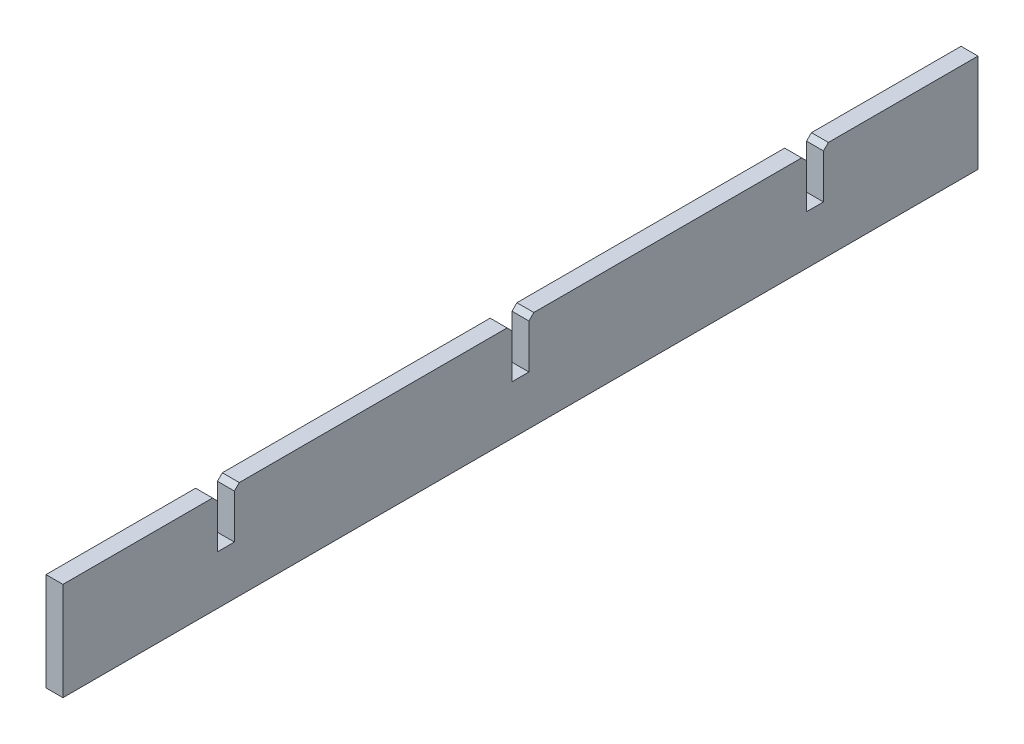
ISO-10303-21;
HEADER;
FILE_DESCRIPTION(('STEP AP214'),'2;1');
FILE_NAME('part.step','',(''),(''),'','','');
FILE_SCHEMA(('AUTOMOTIVE_DESIGN { 1 0 10303 214 1 1 1 1 }'));
ENDSEC;
DATA;
#1=APPLICATION_CONTEXT('core data for automotive mechanical design processes');
#2=APPLICATION_PROTOCOL_DEFINITION('international standard','automotive_design',2000,#1);
#3=PRODUCT_CONTEXT('',#1,'mechanical');
#4=PRODUCT('Part','Part','',(#3));
#5=PRODUCT_RELATED_PRODUCT_CATEGORY('part','',(#4));
#6=PRODUCT_DEFINITION_FORMATION('','',#4);
#7=PRODUCT_DEFINITION_CONTEXT('part definition',#1,'design');
#8=PRODUCT_DEFINITION('design','',#6,#7);
#9=PRODUCT_DEFINITION_SHAPE('','',#8);
#10=(LENGTH_UNIT() NAMED_UNIT(*) SI_UNIT(.MILLI.,.METRE.));
#11=(NAMED_UNIT(*) PLANE_ANGLE_UNIT() SI_UNIT($,.RADIAN.));
#12=(NAMED_UNIT(*) SI_UNIT($,.STERADIAN.) SOLID_ANGLE_UNIT());
#13=UNCERTAINTY_MEASURE_WITH_UNIT(LENGTH_MEASURE(1.E-05),#10,'distance_accuracy_value','');
#14=(GEOMETRIC_REPRESENTATION_CONTEXT(3) GLOBAL_UNCERTAINTY_ASSIGNED_CONTEXT((#13)) GLOBAL_UNIT_ASSIGNED_CONTEXT((#10,
#11,#12)) REPRESENTATION_CONTEXT('',''));
#15=CARTESIAN_POINT('',(0.,0.,0.));
#16=DIRECTION('',(0.,0.,1.));
#17=DIRECTION('',(1.,0.,0.));
#18=AXIS2_PLACEMENT_3D('',#15,#16,#17);
#19=CARTESIAN_POINT('',(17.25,0.,0.));
#20=DIRECTION('',(-1.,0.,0.));
#21=DIRECTION('',(0.,0.,1.));
#22=AXIS2_PLACEMENT_3D('',#19,#20,#21);
#23=PLANE('',#22);
#24=DIRECTION('',(0.,0.,1.));
#25=VECTOR('',#24,1.);
#26=CARTESIAN_POINT('',(17.25,50.,466.));
#27=LINE('',#26,#25);
#28=CARTESIAN_POINT('',(17.25,50.,13.625));
#29=VERTEX_POINT('',#28);
#30=CARTESIAN_POINT('',(17.25,50.,286.375));
#31=VERTEX_POINT('',#30);
#32=EDGE_CURVE('E249',#29,#31,#27,.T.);
#33=ORIENTED_EDGE('',*,*,#32,.T.);
#34=DIRECTION('',(0.,-0.707106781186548,0.707106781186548));
#35=VECTOR('',#34,1.);
#36=CARTESIAN_POINT('',(17.25,50.,286.375));
#37=LINE('',#36,#35);
#38=CARTESIAN_POINT('',(17.25,45.,291.375));
#39=VERTEX_POINT('',#38);
#40=EDGE_CURVE('E187',#31,#39,#37,.T.);
#41=ORIENTED_EDGE('',*,*,#40,.T.);
#42=DIRECTION('',(0.,-1.,0.));
#43=VECTOR('',#42,1.);
#44=CARTESIAN_POINT('',(17.25,0.,291.375));
#45=LINE('',#44,#43);
#46=CARTESIAN_POINT('',(17.25,0.,291.375));
#47=VERTEX_POINT('',#46);
#48=EDGE_CURVE('E182',#39,#47,#45,.T.);
#49=ORIENTED_EDGE('',*,*,#48,.T.);
#50=DIRECTION('',(0.,0.,-1.));
#51=VECTOR('',#50,1.);
#52=CARTESIAN_POINT('',(17.25,0.,0.));
#53=LINE('',#52,#51);
#54=CARTESIAN_POINT('',(17.25,0.,308.625));
#55=VERTEX_POINT('',#54);
#56=EDGE_CURVE('E186',#55,#47,#53,.T.);
#57=ORIENTED_EDGE('',*,*,#56,.F.);
#58=DIRECTION('',(0.,-1.,0.));
#59=VECTOR('',#58,1.);
#60=CARTESIAN_POINT('',(17.25,0.,308.625));
#61=LINE('',#60,#59);
#62=CARTESIAN_POINT('',(17.25,44.9999999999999,308.625));
#63=VERTEX_POINT('',#62);
#64=EDGE_CURVE('E199',#63,#55,#61,.T.);
#65=ORIENTED_EDGE('',*,*,#64,.F.);
#66=DIRECTION('',(0.,-0.70710678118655,-0.707106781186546));
#67=VECTOR('',#66,1.);
#68=CARTESIAN_POINT('',(17.25,50.,313.625));
#69=LINE('',#68,#67);
#70=CARTESIAN_POINT('',(17.25,50.,313.625));
#71=VERTEX_POINT('',#70);
#72=EDGE_CURVE('E336',#63,#71,#69,.F.);
#73=ORIENTED_EDGE('',*,*,#72,.T.);
#74=CARTESIAN_POINT('',(17.25,50.,466.));
#75=VERTEX_POINT('',#74);
#76=EDGE_CURVE('E242',#71,#75,#27,.T.);
#77=ORIENTED_EDGE('',*,*,#76,.T.);
#78=DIRECTION('',(0.,-1.,0.));
#79=VECTOR('',#78,1.);
#80=CARTESIAN_POINT('',(17.25,-50.,466.));
#81=LINE('',#80,#79);
#82=CARTESIAN_POINT('',(17.25,-50.,466.));
#83=VERTEX_POINT('',#82);
#84=EDGE_CURVE('E247',#75,#83,#81,.T.);
#85=ORIENTED_EDGE('',*,*,#84,.T.);
#86=DIRECTION('',(0.,0.,-1.));
#87=VECTOR('',#86,1.);
#88=CARTESIAN_POINT('',(17.25,-50.,466.));
#89=LINE('',#88,#87);
#90=CARTESIAN_POINT('',(17.25,-50.,-466.));
#91=VERTEX_POINT('',#90);
#92=EDGE_CURVE('E251',#83,#91,#89,.T.);
#93=ORIENTED_EDGE('',*,*,#92,.T.);
#94=DIRECTION('',(0.,1.,0.));
#95=VECTOR('',#94,1.);
#96=CARTESIAN_POINT('',(17.25,-50.,-466.));
#97=LINE('',#96,#95);
#98=CARTESIAN_POINT('',(17.25,50.,-466.));
#99=VERTEX_POINT('',#98);
#100=EDGE_CURVE('E239',#91,#99,#97,.T.);
#101=ORIENTED_EDGE('',*,*,#100,.T.);
#102=CARTESIAN_POINT('',(17.25,49.9999999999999,-313.625));
#103=VERTEX_POINT('',#102);
#104=EDGE_CURVE('E244',#99,#103,#27,.T.);
#105=ORIENTED_EDGE('',*,*,#104,.T.);
#106=DIRECTION('',(0.,-0.707106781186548,0.707106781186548));
#107=VECTOR('',#106,1.);
#108=CARTESIAN_POINT('',(17.25,50.,-313.625));
#109=LINE('',#108,#107);
#110=CARTESIAN_POINT('',(17.25,44.9999999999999,-308.625));
#111=VERTEX_POINT('',#110);
#112=EDGE_CURVE('E320',#103,#111,#109,.T.);
#113=ORIENTED_EDGE('',*,*,#112,.T.);
#114=DIRECTION('',(0.,-1.,0.));
#115=VECTOR('',#114,1.);
#116=CARTESIAN_POINT('',(17.25,0.,-308.625));
#117=LINE('',#116,#115);
#118=CARTESIAN_POINT('',(17.25,0.,-308.625));
#119=VERTEX_POINT('',#118);
#120=EDGE_CURVE('E206',#111,#119,#117,.T.);
#121=ORIENTED_EDGE('',*,*,#120,.T.);
#122=DIRECTION('',(0.,0.,-1.));
#123=VECTOR('',#122,1.);
#124=CARTESIAN_POINT('',(17.25,0.,0.));
#125=LINE('',#124,#123);
#126=CARTESIAN_POINT('',(17.25,0.,-291.375));
#127=VERTEX_POINT('',#126);
#128=EDGE_CURVE('E219',#127,#119,#125,.T.);
#129=ORIENTED_EDGE('',*,*,#128,.F.);
#130=DIRECTION('',(0.,-1.,0.));
#131=VECTOR('',#130,1.);
#132=CARTESIAN_POINT('',(17.25,0.,-291.375));
#133=LINE('',#132,#131);
#134=CARTESIAN_POINT('',(17.25,45.,-291.375));
#135=VERTEX_POINT('',#134);
#136=EDGE_CURVE('E217',#135,#127,#133,.T.);
#137=ORIENTED_EDGE('',*,*,#136,.F.);
#138=DIRECTION('',(0.,-0.707106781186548,-0.707106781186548));
#139=VECTOR('',#138,1.);
#140=CARTESIAN_POINT('',(17.25,45.,-291.375));
#141=LINE('',#140,#139);
#142=CARTESIAN_POINT('',(17.25,50.,-286.375));
#143=VERTEX_POINT('',#142);
#144=EDGE_CURVE('E318',#135,#143,#141,.F.);
#145=ORIENTED_EDGE('',*,*,#144,.T.);
#146=CARTESIAN_POINT('',(17.25,50.,-13.6249999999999));
#147=VERTEX_POINT('',#146);
#148=EDGE_CURVE('E248',#143,#147,#27,.T.);
#149=ORIENTED_EDGE('',*,*,#148,.T.);
#150=DIRECTION('',(0.,-0.707106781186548,0.707106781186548));
#151=VECTOR('',#150,1.);
#152=CARTESIAN_POINT('',(17.25,50.,-13.625));
#153=LINE('',#152,#151);
#154=CARTESIAN_POINT('',(17.25,45.,-8.62499999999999));
#155=VERTEX_POINT('',#154);
#156=EDGE_CURVE('E290',#147,#155,#153,.T.);
#157=ORIENTED_EDGE('',*,*,#156,.T.);
#158=DIRECTION('',(0.,-1.,0.));
#159=VECTOR('',#158,1.);
#160=CARTESIAN_POINT('',(17.25,0.,-8.625));
#161=LINE('',#160,#159);
#162=CARTESIAN_POINT('',(17.25,0.,-8.625));
#163=VERTEX_POINT('',#162);
#164=EDGE_CURVE('E225',#155,#163,#161,.T.);
#165=ORIENTED_EDGE('',*,*,#164,.T.);
#166=DIRECTION('',(0.,0.,-1.));
#167=VECTOR('',#166,1.);
#168=CARTESIAN_POINT('',(17.25,0.,0.));
#169=LINE('',#168,#167);
#170=CARTESIAN_POINT('',(17.25,0.,8.625));
#171=VERTEX_POINT('',#170);
#172=EDGE_CURVE('E232',#171,#163,#169,.T.);
#173=ORIENTED_EDGE('',*,*,#172,.F.);
#174=DIRECTION('',(0.,-1.,0.));
#175=VECTOR('',#174,1.);
#176=CARTESIAN_POINT('',(17.25,0.,8.625));
#177=LINE('',#176,#175);
#178=CARTESIAN_POINT('',(17.25,45.,8.62499999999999));
#179=VERTEX_POINT('',#178);
#180=EDGE_CURVE('E230',#179,#171,#177,.T.);
#181=ORIENTED_EDGE('',*,*,#180,.F.);
#182=DIRECTION('',(0.,-0.707106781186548,-0.707106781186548));
#183=VECTOR('',#182,1.);
#184=CARTESIAN_POINT('',(17.25,45.,8.62499999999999));
#185=LINE('',#184,#183);
#186=EDGE_CURVE('E288',#179,#29,#185,.F.);
#187=ORIENTED_EDGE('',*,*,#186,.T.);
#188=EDGE_LOOP('',(#33,#41,#49,#57,#65,#73,#77,#85,#93,#101,#105,#113,#121,#129,#137,#145,#149,
#157,#165,#173,#181,#187));
#189=FACE_BOUND('',#188,.T.);
#190=ADVANCED_FACE('F33',(#189),#23,.F.);
#191=CARTESIAN_POINT('',(0.,0.,0.));
#192=DIRECTION('',(-1.,0.,0.));
#193=DIRECTION('',(0.,0.,1.));
#194=AXIS2_PLACEMENT_3D('',#191,#192,#193);
#195=PLANE('',#194);
#196=DIRECTION('',(0.,1.,0.));
#197=VECTOR('',#196,1.);
#198=CARTESIAN_POINT('',(0.,0.,291.375));
#199=LINE('',#198,#197);
#200=CARTESIAN_POINT('',(0.,0.,291.375));
#201=VERTEX_POINT('',#200);
#202=CARTESIAN_POINT('',(0.,45.,291.375));
#203=VERTEX_POINT('',#202);
#204=EDGE_CURVE('E204',#201,#203,#199,.T.);
#205=ORIENTED_EDGE('',*,*,#204,.T.);
#206=DIRECTION('',(0.,0.707106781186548,-0.707106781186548));
#207=VECTOR('',#206,1.);
#208=CARTESIAN_POINT('',(0.,168.1875,168.1875));
#209=LINE('',#208,#207);
#210=CARTESIAN_POINT('',(0.,50.,286.375));
#211=VERTEX_POINT('',#210);
#212=EDGE_CURVE('E342',#203,#211,#209,.T.);
#213=ORIENTED_EDGE('',*,*,#212,.T.);
#214=DIRECTION('',(0.,0.,1.));
#215=VECTOR('',#214,1.);
#216=CARTESIAN_POINT('',(0.,50.,466.));
#217=LINE('',#216,#215);
#218=CARTESIAN_POINT('',(0.,50.0000000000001,13.6250000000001));
#219=VERTEX_POINT('',#218);
#220=EDGE_CURVE('E262',#219,#211,#217,.T.);
#221=ORIENTED_EDGE('',*,*,#220,.F.);
#222=DIRECTION('',(0.,0.707106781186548,0.707106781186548));
#223=VECTOR('',#222,1.);
#224=CARTESIAN_POINT('',(0.,18.1875,-18.1875));
#225=LINE('',#224,#223);
#226=CARTESIAN_POINT('',(0.,45.,8.62499999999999));
#227=VERTEX_POINT('',#226);
#228=EDGE_CURVE('E294',#219,#227,#225,.F.);
#229=ORIENTED_EDGE('',*,*,#228,.T.);
#230=DIRECTION('',(0.,1.,0.));
#231=VECTOR('',#230,1.);
#232=CARTESIAN_POINT('',(0.,0.,8.625));
#233=LINE('',#232,#231);
#234=CARTESIAN_POINT('',(0.,0.,8.625));
#235=VERTEX_POINT('',#234);
#236=EDGE_CURVE('E276',#235,#227,#233,.T.);
#237=ORIENTED_EDGE('',*,*,#236,.F.);
#238=DIRECTION('',(0.,0.,1.));
#239=VECTOR('',#238,1.);
#240=CARTESIAN_POINT('',(0.,0.,0.));
#241=LINE('',#240,#239);
#242=CARTESIAN_POINT('',(0.,0.,-8.625));
#243=VERTEX_POINT('',#242);
#244=EDGE_CURVE('E279',#243,#235,#241,.T.);
#245=ORIENTED_EDGE('',*,*,#244,.F.);
#246=DIRECTION('',(0.,1.,0.));
#247=VECTOR('',#246,1.);
#248=CARTESIAN_POINT('',(0.,0.,-8.625));
#249=LINE('',#248,#247);
#250=CARTESIAN_POINT('',(0.,45.,-8.62499999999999));
#251=VERTEX_POINT('',#250);
#252=EDGE_CURVE('E282',#243,#251,#249,.T.);
#253=ORIENTED_EDGE('',*,*,#252,.T.);
#254=DIRECTION('',(0.,0.707106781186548,-0.707106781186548));
#255=VECTOR('',#254,1.);
#256=CARTESIAN_POINT('',(0.,18.1875,18.1875));
#257=LINE('',#256,#255);
#258=CARTESIAN_POINT('',(0.,50.,-13.6249999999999));
#259=VERTEX_POINT('',#258);
#260=EDGE_CURVE('E296',#251,#259,#257,.T.);
#261=ORIENTED_EDGE('',*,*,#260,.T.);
#262=CARTESIAN_POINT('',(0.,50.0000000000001,-286.375));
#263=VERTEX_POINT('',#262);
#264=EDGE_CURVE('E261',#263,#259,#217,.T.);
#265=ORIENTED_EDGE('',*,*,#264,.F.);
#266=DIRECTION('',(0.,0.707106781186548,0.707106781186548));
#267=VECTOR('',#266,1.);
#268=CARTESIAN_POINT('',(0.,168.1875,-168.1875));
#269=LINE('',#268,#267);
#270=CARTESIAN_POINT('',(0.,44.9999999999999,-291.375));
#271=VERTEX_POINT('',#270);
#272=EDGE_CURVE('E324',#263,#271,#269,.F.);
#273=ORIENTED_EDGE('',*,*,#272,.T.);
#274=DIRECTION('',(0.,1.,0.));
#275=VECTOR('',#274,1.);
#276=CARTESIAN_POINT('',(0.,0.,-291.375));
#277=LINE('',#276,#275);
#278=CARTESIAN_POINT('',(0.,0.,-291.375));
#279=VERTEX_POINT('',#278);
#280=EDGE_CURVE('E304',#279,#271,#277,.T.);
#281=ORIENTED_EDGE('',*,*,#280,.F.);
#282=DIRECTION('',(0.,0.,1.));
#283=VECTOR('',#282,1.);
#284=CARTESIAN_POINT('',(0.,0.,0.));
#285=LINE('',#284,#283);
#286=CARTESIAN_POINT('',(0.,0.,-308.625));
#287=VERTEX_POINT('',#286);
#288=EDGE_CURVE('E307',#287,#279,#285,.T.);
#289=ORIENTED_EDGE('',*,*,#288,.F.);
#290=DIRECTION('',(0.,1.,0.));
#291=VECTOR('',#290,1.);
#292=CARTESIAN_POINT('',(0.,0.,-308.625));
#293=LINE('',#292,#291);
#294=CARTESIAN_POINT('',(0.,44.9999999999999,-308.625));
#295=VERTEX_POINT('',#294);
#296=EDGE_CURVE('E312',#287,#295,#293,.T.);
#297=ORIENTED_EDGE('',*,*,#296,.T.);
#298=DIRECTION('',(0.,0.707106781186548,-0.707106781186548));
#299=VECTOR('',#298,1.);
#300=CARTESIAN_POINT('',(0.,-131.8125,-131.8125));
#301=LINE('',#300,#299);
#302=CARTESIAN_POINT('',(0.,50.,-313.625));
#303=VERTEX_POINT('',#302);
#304=EDGE_CURVE('E326',#295,#303,#301,.T.);
#305=ORIENTED_EDGE('',*,*,#304,.T.);
#306=CARTESIAN_POINT('',(0.,50.,-466.));
#307=VERTEX_POINT('',#306);
#308=EDGE_CURVE('E257',#307,#303,#217,.T.);
#309=ORIENTED_EDGE('',*,*,#308,.F.);
#310=DIRECTION('',(0.,1.,0.));
#311=VECTOR('',#310,1.);
#312=CARTESIAN_POINT('',(0.,-50.,-466.));
#313=LINE('',#312,#311);
#314=CARTESIAN_POINT('',(0.,-50.,-466.));
#315=VERTEX_POINT('',#314);
#316=EDGE_CURVE('E238',#315,#307,#313,.T.);
#317=ORIENTED_EDGE('',*,*,#316,.F.);
#318=DIRECTION('',(0.,0.,-1.));
#319=VECTOR('',#318,1.);
#320=CARTESIAN_POINT('',(0.,-50.,466.));
#321=LINE('',#320,#319);
#322=CARTESIAN_POINT('',(0.,-50.,466.));
#323=VERTEX_POINT('',#322);
#324=EDGE_CURVE('E243',#323,#315,#321,.T.);
#325=ORIENTED_EDGE('',*,*,#324,.F.);
#326=DIRECTION('',(0.,-1.,0.));
#327=VECTOR('',#326,1.);
#328=CARTESIAN_POINT('',(0.,-50.,466.));
#329=LINE('',#328,#327);
#330=CARTESIAN_POINT('',(0.,50.,466.));
#331=VERTEX_POINT('',#330);
#332=EDGE_CURVE('E260',#331,#323,#329,.T.);
#333=ORIENTED_EDGE('',*,*,#332,.F.);
#334=CARTESIAN_POINT('',(0.,50.0000000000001,313.625));
#335=VERTEX_POINT('',#334);
#336=EDGE_CURVE('E256',#335,#331,#217,.T.);
#337=ORIENTED_EDGE('',*,*,#336,.F.);
#338=DIRECTION('',(0.,0.70710678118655,0.707106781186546));
#339=VECTOR('',#338,1.);
#340=CARTESIAN_POINT('',(0.,-131.8125,131.812500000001));
#341=LINE('',#340,#339);
#342=CARTESIAN_POINT('',(0.,44.9999999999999,308.625));
#343=VERTEX_POINT('',#342);
#344=EDGE_CURVE('E48',#335,#343,#341,.F.);
#345=ORIENTED_EDGE('',*,*,#344,.T.);
#346=DIRECTION('',(0.,1.,0.));
#347=VECTOR('',#346,1.);
#348=CARTESIAN_POINT('',(0.,0.,308.625));
#349=LINE('',#348,#347);
#350=CARTESIAN_POINT('',(0.,0.,308.625));
#351=VERTEX_POINT('',#350);
#352=EDGE_CURVE('E215',#351,#343,#349,.T.);
#353=ORIENTED_EDGE('',*,*,#352,.F.);
#354=DIRECTION('',(0.,0.,1.));
#355=VECTOR('',#354,1.);
#356=CARTESIAN_POINT('',(0.,0.,0.));
#357=LINE('',#356,#355);
#358=EDGE_CURVE('E310',#201,#351,#357,.T.);
#359=ORIENTED_EDGE('',*,*,#358,.F.);
#360=EDGE_LOOP('',(#205,#213,#221,#229,#237,#245,#253,#261,#265,#273,#281,#289,#297,#305,#309,
#317,#325,#333,#337,#345,#353,#359));
#361=FACE_BOUND('',#360,.T.);
#362=ADVANCED_FACE('F349',(#361),#195,.T.);
#363=CARTESIAN_POINT('',(17.25,50.,466.));
#364=DIRECTION('',(0.,-1.,0.));
#365=DIRECTION('',(0.,0.,-1.));
#366=AXIS2_PLACEMENT_3D('',#363,#364,#365);
#367=PLANE('',#366);
#368=ORIENTED_EDGE('',*,*,#220,.T.);
#369=DIRECTION('',(1.,0.,0.));
#370=VECTOR('',#369,1.);
#371=CARTESIAN_POINT('',(17.25,50.,286.375));
#372=LINE('',#371,#370);
#373=EDGE_CURVE('E333',#211,#31,#372,.T.);
#374=ORIENTED_EDGE('',*,*,#373,.T.);
#375=ORIENTED_EDGE('',*,*,#32,.F.);
#376=DIRECTION('',(-1.,0.,0.));
#377=VECTOR('',#376,1.);
#378=CARTESIAN_POINT('',(17.25,50.,13.625));
#379=LINE('',#378,#377);
#380=EDGE_CURVE('E302',#29,#219,#379,.T.);
#381=ORIENTED_EDGE('',*,*,#380,.T.);
#382=EDGE_LOOP('',(#368,#374,#375,#381));
#383=FACE_BOUND('',#382,.T.);
#384=ADVANCED_FACE('F384',(#383),#367,.F.);
#385=ORIENTED_EDGE('',*,*,#308,.T.);
#386=DIRECTION('',(1.,0.,0.));
#387=VECTOR('',#386,1.);
#388=CARTESIAN_POINT('',(17.25,50.,-313.625));
#389=LINE('',#388,#387);
#390=EDGE_CURVE('E315',#303,#103,#389,.T.);
#391=ORIENTED_EDGE('',*,*,#390,.T.);
#392=ORIENTED_EDGE('',*,*,#104,.F.);
#393=DIRECTION('',(-1.,0.,0.));
#394=VECTOR('',#393,1.);
#395=CARTESIAN_POINT('',(17.25,50.,-466.));
#396=LINE('',#395,#394);
#397=EDGE_CURVE('E273',#99,#307,#396,.T.);
#398=ORIENTED_EDGE('',*,*,#397,.T.);
#399=EDGE_LOOP('',(#385,#391,#392,#398));
#400=FACE_BOUND('',#399,.T.);
#401=ADVANCED_FACE('F403',(#400),#367,.F.);
#402=ORIENTED_EDGE('',*,*,#148,.F.);
#403=DIRECTION('',(-1.,0.,0.));
#404=VECTOR('',#403,1.);
#405=CARTESIAN_POINT('',(17.25,50.,-286.375));
#406=LINE('',#405,#404);
#407=EDGE_CURVE('E331',#143,#263,#406,.T.);
#408=ORIENTED_EDGE('',*,*,#407,.T.);
#409=ORIENTED_EDGE('',*,*,#264,.T.);
#410=DIRECTION('',(1.,0.,0.));
#411=VECTOR('',#410,1.);
#412=CARTESIAN_POINT('',(17.25,50.,-13.625));
#413=LINE('',#412,#411);
#414=EDGE_CURVE('E285',#259,#147,#413,.T.);
#415=ORIENTED_EDGE('',*,*,#414,.T.);
#416=EDGE_LOOP('',(#402,#408,#409,#415));
#417=FACE_BOUND('',#416,.T.);
#418=ADVANCED_FACE('F355',(#417),#367,.F.);
#419=CARTESIAN_POINT('',(17.25,-50.,-466.));
#420=DIRECTION('',(0.,0.,1.));
#421=DIRECTION('',(1.,0.,0.));
#422=AXIS2_PLACEMENT_3D('',#419,#420,#421);
#423=PLANE('',#422);
#424=ORIENTED_EDGE('',*,*,#316,.T.);
#425=ORIENTED_EDGE('',*,*,#397,.F.);
#426=ORIENTED_EDGE('',*,*,#100,.F.);
#427=DIRECTION('',(-1.,0.,0.));
#428=VECTOR('',#427,1.);
#429=CARTESIAN_POINT('',(17.25,-50.,-466.));
#430=LINE('',#429,#428);
#431=EDGE_CURVE('E253',#91,#315,#430,.T.);
#432=ORIENTED_EDGE('',*,*,#431,.T.);
#433=EDGE_LOOP('',(#424,#425,#426,#432));
#434=FACE_BOUND('',#433,.T.);
#435=ADVANCED_FACE('F400',(#434),#423,.F.);
#436=ORIENTED_EDGE('',*,*,#76,.F.);
#437=DIRECTION('',(-1.,0.,0.));
#438=VECTOR('',#437,1.);
#439=CARTESIAN_POINT('',(17.25,50.,313.625));
#440=LINE('',#439,#438);
#441=EDGE_CURVE('E41',#71,#335,#440,.T.);
#442=ORIENTED_EDGE('',*,*,#441,.T.);
#443=ORIENTED_EDGE('',*,*,#336,.T.);
#444=DIRECTION('',(-1.,0.,0.));
#445=VECTOR('',#444,1.);
#446=CARTESIAN_POINT('',(17.25,50.,466.));
#447=LINE('',#446,#445);
#448=EDGE_CURVE('E270',#75,#331,#447,.T.);
#449=ORIENTED_EDGE('',*,*,#448,.F.);
#450=EDGE_LOOP('',(#436,#442,#443,#449));
#451=FACE_BOUND('',#450,.T.);
#452=ADVANCED_FACE('F345',(#451),#367,.F.);
#453=CARTESIAN_POINT('',(17.25,-50.,466.));
#454=DIRECTION('',(0.,0.,-1.));
#455=DIRECTION('',(-1.,0.,0.));
#456=AXIS2_PLACEMENT_3D('',#453,#454,#455);
#457=PLANE('',#456);
#458=ORIENTED_EDGE('',*,*,#332,.T.);
#459=DIRECTION('',(-1.,0.,0.));
#460=VECTOR('',#459,1.);
#461=CARTESIAN_POINT('',(17.25,-50.,466.));
#462=LINE('',#461,#460);
#463=EDGE_CURVE('E267',#83,#323,#462,.T.);
#464=ORIENTED_EDGE('',*,*,#463,.F.);
#465=ORIENTED_EDGE('',*,*,#84,.F.);
#466=ORIENTED_EDGE('',*,*,#448,.T.);
#467=EDGE_LOOP('',(#458,#464,#465,#466));
#468=FACE_BOUND('',#467,.T.);
#469=ADVANCED_FACE('F392',(#468),#457,.F.);
#470=CARTESIAN_POINT('',(17.25,-50.,466.));
#471=DIRECTION('',(0.,1.,0.));
#472=DIRECTION('',(0.,0.,1.));
#473=AXIS2_PLACEMENT_3D('',#470,#471,#472);
#474=PLANE('',#473);
#475=ORIENTED_EDGE('',*,*,#324,.T.);
#476=ORIENTED_EDGE('',*,*,#431,.F.);
#477=ORIENTED_EDGE('',*,*,#92,.F.);
#478=ORIENTED_EDGE('',*,*,#463,.T.);
#479=EDGE_LOOP('',(#475,#476,#477,#478));
#480=FACE_BOUND('',#479,.T.);
#481=ADVANCED_FACE('F396',(#480),#474,.F.);
#482=CARTESIAN_POINT('',(-0.749999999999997,0.,0.));
#483=DIRECTION('',(0.,-1.,0.));
#484=DIRECTION('',(0.,0.,-1.));
#485=AXIS2_PLACEMENT_3D('',#482,#483,#484);
#486=PLANE('',#485);
#487=ORIENTED_EDGE('',*,*,#244,.T.);
#488=DIRECTION('',(1.,0.,0.));
#489=VECTOR('',#488,1.);
#490=CARTESIAN_POINT('',(-0.749999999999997,0.,8.625));
#491=LINE('',#490,#489);
#492=EDGE_CURVE('E235',#235,#171,#491,.T.);
#493=ORIENTED_EDGE('',*,*,#492,.T.);
#494=ORIENTED_EDGE('',*,*,#172,.T.);
#495=DIRECTION('',(1.,0.,0.));
#496=VECTOR('',#495,1.);
#497=CARTESIAN_POINT('',(-0.749999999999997,0.,-8.625));
#498=LINE('',#497,#496);
#499=EDGE_CURVE('E227',#243,#163,#498,.T.);
#500=ORIENTED_EDGE('',*,*,#499,.F.);
#501=EDGE_LOOP('',(#487,#493,#494,#500));
#502=FACE_BOUND('',#501,.T.);
#503=ADVANCED_FACE('F371',(#502),#486,.F.);
#504=CARTESIAN_POINT('',(-0.749999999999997,0.,8.625));
#505=DIRECTION('',(0.,0.,1.));
#506=DIRECTION('',(0.,-1.,0.));
#507=AXIS2_PLACEMENT_3D('',#504,#505,#506);
#508=PLANE('',#507);
#509=ORIENTED_EDGE('',*,*,#236,.T.);
#510=DIRECTION('',(1.,0.,0.));
#511=VECTOR('',#510,1.);
#512=CARTESIAN_POINT('',(-0.749999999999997,45.,8.62499999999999));
#513=LINE('',#512,#511);
#514=EDGE_CURVE('E299',#227,#179,#513,.T.);
#515=ORIENTED_EDGE('',*,*,#514,.T.);
#516=ORIENTED_EDGE('',*,*,#180,.T.);
#517=ORIENTED_EDGE('',*,*,#492,.F.);
#518=EDGE_LOOP('',(#509,#515,#516,#517));
#519=FACE_BOUND('',#518,.T.);
#520=ADVANCED_FACE('F376',(#519),#508,.F.);
#521=CARTESIAN_POINT('',(-0.749999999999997,0.,-8.625));
#522=DIRECTION('',(0.,0.,1.));
#523=DIRECTION('',(0.,-1.,0.));
#524=AXIS2_PLACEMENT_3D('',#521,#522,#523);
#525=PLANE('',#524);
#526=ORIENTED_EDGE('',*,*,#164,.F.);
#527=DIRECTION('',(-1.,0.,0.));
#528=VECTOR('',#527,1.);
#529=CARTESIAN_POINT('',(0.,45.,-8.62499999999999));
#530=LINE('',#529,#528);
#531=EDGE_CURVE('E292',#155,#251,#530,.T.);
#532=ORIENTED_EDGE('',*,*,#531,.T.);
#533=ORIENTED_EDGE('',*,*,#252,.F.);
#534=ORIENTED_EDGE('',*,*,#499,.T.);
#535=EDGE_LOOP('',(#526,#532,#533,#534));
#536=FACE_BOUND('',#535,.T.);
#537=ADVANCED_FACE('F368',(#536),#525,.T.);
#538=CARTESIAN_POINT('',(17.25,50.,-13.625));
#539=DIRECTION('',(0.,0.707106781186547,0.707106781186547));
#540=DIRECTION('',(-1.,0.,0.));
#541=AXIS2_PLACEMENT_3D('',#538,#539,#540);
#542=PLANE('',#541);
#543=ORIENTED_EDGE('',*,*,#260,.F.);
#544=ORIENTED_EDGE('',*,*,#531,.F.);
#545=ORIENTED_EDGE('',*,*,#156,.F.);
#546=ORIENTED_EDGE('',*,*,#414,.F.);
#547=EDGE_LOOP('',(#543,#544,#545,#546));
#548=FACE_BOUND('',#547,.T.);
#549=ADVANCED_FACE('F364',(#548),#542,.T.);
#550=CARTESIAN_POINT('',(-0.749999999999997,45.,8.62499999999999));
#551=DIRECTION('',(0.,-0.707106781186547,0.707106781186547));
#552=DIRECTION('',(1.,0.,0.));
#553=AXIS2_PLACEMENT_3D('',#550,#551,#552);
#554=PLANE('',#553);
#555=ORIENTED_EDGE('',*,*,#228,.F.);
#556=ORIENTED_EDGE('',*,*,#380,.F.);
#557=ORIENTED_EDGE('',*,*,#186,.F.);
#558=ORIENTED_EDGE('',*,*,#514,.F.);
#559=EDGE_LOOP('',(#555,#556,#557,#558));
#560=FACE_BOUND('',#559,.T.);
#561=ADVANCED_FACE('F380',(#560),#554,.F.);
#562=CARTESIAN_POINT('',(-0.749999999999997,0.,0.));
#563=DIRECTION('',(0.,-1.,0.));
#564=DIRECTION('',(0.,0.,-1.));
#565=AXIS2_PLACEMENT_3D('',#562,#563,#564);
#566=PLANE('',#565);
#567=ORIENTED_EDGE('',*,*,#288,.T.);
#568=DIRECTION('',(1.,0.,0.));
#569=VECTOR('',#568,1.);
#570=CARTESIAN_POINT('',(-0.749999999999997,0.,-291.375));
#571=LINE('',#570,#569);
#572=EDGE_CURVE('E222',#279,#127,#571,.T.);
#573=ORIENTED_EDGE('',*,*,#572,.T.);
#574=ORIENTED_EDGE('',*,*,#128,.T.);
#575=DIRECTION('',(1.,0.,0.));
#576=VECTOR('',#575,1.);
#577=CARTESIAN_POINT('',(-0.749999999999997,0.,-308.625));
#578=LINE('',#577,#576);
#579=EDGE_CURVE('E210',#287,#119,#578,.T.);
#580=ORIENTED_EDGE('',*,*,#579,.F.);
#581=EDGE_LOOP('',(#567,#573,#574,#580));
#582=FACE_BOUND('',#581,.T.);
#583=ADVANCED_FACE('F416',(#582),#566,.F.);
#584=CARTESIAN_POINT('',(-0.749999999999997,0.,-291.375));
#585=DIRECTION('',(0.,0.,1.));
#586=DIRECTION('',(0.,-1.,0.));
#587=AXIS2_PLACEMENT_3D('',#584,#585,#586);
#588=PLANE('',#587);
#589=ORIENTED_EDGE('',*,*,#280,.T.);
#590=DIRECTION('',(1.,0.,0.));
#591=VECTOR('',#590,1.);
#592=CARTESIAN_POINT('',(-0.749999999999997,45.,-291.375));
#593=LINE('',#592,#591);
#594=EDGE_CURVE('E328',#271,#135,#593,.T.);
#595=ORIENTED_EDGE('',*,*,#594,.T.);
#596=ORIENTED_EDGE('',*,*,#136,.T.);
#597=ORIENTED_EDGE('',*,*,#572,.F.);
#598=EDGE_LOOP('',(#589,#595,#596,#597));
#599=FACE_BOUND('',#598,.T.);
#600=ADVANCED_FACE('F420',(#599),#588,.F.);
#601=CARTESIAN_POINT('',(-0.749999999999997,0.,0.));
#602=DIRECTION('',(0.,-1.,0.));
#603=DIRECTION('',(0.,0.,-1.));
#604=AXIS2_PLACEMENT_3D('',#601,#602,#603);
#605=PLANE('',#604);
#606=ORIENTED_EDGE('',*,*,#358,.T.);
#607=DIRECTION('',(1.,0.,0.));
#608=VECTOR('',#607,1.);
#609=CARTESIAN_POINT('',(-0.749999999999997,0.,308.625));
#610=LINE('',#609,#608);
#611=EDGE_CURVE('E198',#351,#55,#610,.T.);
#612=ORIENTED_EDGE('',*,*,#611,.T.);
#613=ORIENTED_EDGE('',*,*,#56,.T.);
#614=DIRECTION('',(1.,0.,0.));
#615=VECTOR('',#614,1.);
#616=CARTESIAN_POINT('',(-0.749999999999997,0.,291.375));
#617=LINE('',#616,#615);
#618=EDGE_CURVE('E191',#201,#47,#617,.T.);
#619=ORIENTED_EDGE('',*,*,#618,.F.);
#620=EDGE_LOOP('',(#606,#612,#613,#619));
#621=FACE_BOUND('',#620,.T.);
#622=ADVANCED_FACE('F196',(#621),#605,.F.);
#623=CARTESIAN_POINT('',(-0.749999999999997,0.,308.625));
#624=DIRECTION('',(0.,0.,1.));
#625=DIRECTION('',(0.,-1.,0.));
#626=AXIS2_PLACEMENT_3D('',#623,#624,#625);
#627=PLANE('',#626);
#628=ORIENTED_EDGE('',*,*,#352,.T.);
#629=DIRECTION('',(1.,0.,0.));
#630=VECTOR('',#629,1.);
#631=CARTESIAN_POINT('',(-0.749999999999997,44.9999999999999,308.625));
#632=LINE('',#631,#630);
#633=EDGE_CURVE('E11',#343,#63,#632,.T.);
#634=ORIENTED_EDGE('',*,*,#633,.T.);
#635=ORIENTED_EDGE('',*,*,#64,.T.);
#636=ORIENTED_EDGE('',*,*,#611,.F.);
#637=EDGE_LOOP('',(#628,#634,#635,#636));
#638=FACE_BOUND('',#637,.T.);
#639=ADVANCED_FACE('F460',(#638),#627,.F.);
#640=CARTESIAN_POINT('',(-0.749999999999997,0.,-308.625));
#641=DIRECTION('',(0.,0.,1.));
#642=DIRECTION('',(0.,-1.,0.));
#643=AXIS2_PLACEMENT_3D('',#640,#641,#642);
#644=PLANE('',#643);
#645=ORIENTED_EDGE('',*,*,#120,.F.);
#646=DIRECTION('',(-1.,0.,0.));
#647=VECTOR('',#646,1.);
#648=CARTESIAN_POINT('',(0.,44.9999999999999,-308.625));
#649=LINE('',#648,#647);
#650=EDGE_CURVE('E322',#111,#295,#649,.T.);
#651=ORIENTED_EDGE('',*,*,#650,.T.);
#652=ORIENTED_EDGE('',*,*,#296,.F.);
#653=ORIENTED_EDGE('',*,*,#579,.T.);
#654=EDGE_LOOP('',(#645,#651,#652,#653));
#655=FACE_BOUND('',#654,.T.);
#656=ADVANCED_FACE('F412',(#655),#644,.T.);
#657=CARTESIAN_POINT('',(-0.749999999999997,0.,291.375));
#658=DIRECTION('',(0.,0.,1.));
#659=DIRECTION('',(0.,-1.,0.));
#660=AXIS2_PLACEMENT_3D('',#657,#658,#659);
#661=PLANE('',#660);
#662=ORIENTED_EDGE('',*,*,#48,.F.);
#663=DIRECTION('',(-1.,0.,0.));
#664=VECTOR('',#663,1.);
#665=CARTESIAN_POINT('',(0.,45.,291.375));
#666=LINE('',#665,#664);
#667=EDGE_CURVE('E339',#39,#203,#666,.T.);
#668=ORIENTED_EDGE('',*,*,#667,.T.);
#669=ORIENTED_EDGE('',*,*,#204,.F.);
#670=ORIENTED_EDGE('',*,*,#618,.T.);
#671=EDGE_LOOP('',(#662,#668,#669,#670));
#672=FACE_BOUND('',#671,.T.);
#673=ADVANCED_FACE('F202',(#672),#661,.T.);
#674=CARTESIAN_POINT('',(17.25,50.,-313.625));
#675=DIRECTION('',(0.,0.707106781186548,0.707106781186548));
#676=DIRECTION('',(-1.,0.,0.));
#677=AXIS2_PLACEMENT_3D('',#674,#675,#676);
#678=PLANE('',#677);
#679=ORIENTED_EDGE('',*,*,#304,.F.);
#680=ORIENTED_EDGE('',*,*,#650,.F.);
#681=ORIENTED_EDGE('',*,*,#112,.F.);
#682=ORIENTED_EDGE('',*,*,#390,.F.);
#683=EDGE_LOOP('',(#679,#680,#681,#682));
#684=FACE_BOUND('',#683,.T.);
#685=ADVANCED_FACE('F407',(#684),#678,.T.);
#686=CARTESIAN_POINT('',(-0.749999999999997,45.,-291.375));
#687=DIRECTION('',(0.,-0.707106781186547,0.707106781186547));
#688=DIRECTION('',(1.,0.,0.));
#689=AXIS2_PLACEMENT_3D('',#686,#687,#688);
#690=PLANE('',#689);
#691=ORIENTED_EDGE('',*,*,#272,.F.);
#692=ORIENTED_EDGE('',*,*,#407,.F.);
#693=ORIENTED_EDGE('',*,*,#144,.F.);
#694=ORIENTED_EDGE('',*,*,#594,.F.);
#695=EDGE_LOOP('',(#691,#692,#693,#694));
#696=FACE_BOUND('',#695,.T.);
#697=ADVANCED_FACE('F423',(#696),#690,.F.);
#698=CARTESIAN_POINT('',(17.25,50.,286.375));
#699=DIRECTION('',(0.,0.707106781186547,0.707106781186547));
#700=DIRECTION('',(-1.,0.,0.));
#701=AXIS2_PLACEMENT_3D('',#698,#699,#700);
#702=PLANE('',#701);
#703=ORIENTED_EDGE('',*,*,#212,.F.);
#704=ORIENTED_EDGE('',*,*,#667,.F.);
#705=ORIENTED_EDGE('',*,*,#40,.F.);
#706=ORIENTED_EDGE('',*,*,#373,.F.);
#707=EDGE_LOOP('',(#703,#704,#705,#706));
#708=FACE_BOUND('',#707,.T.);
#709=ADVANCED_FACE('F388',(#708),#702,.T.);
#710=CARTESIAN_POINT('',(17.25,50.,313.625));
#711=DIRECTION('',(0.,-0.707106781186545,0.707106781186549));
#712=DIRECTION('',(-1.,0.,0.));
#713=AXIS2_PLACEMENT_3D('',#710,#711,#712);
#714=PLANE('',#713);
#715=ORIENTED_EDGE('',*,*,#72,.F.);
#716=ORIENTED_EDGE('',*,*,#633,.F.);
#717=ORIENTED_EDGE('',*,*,#344,.F.);
#718=ORIENTED_EDGE('',*,*,#441,.F.);
#719=EDGE_LOOP('',(#715,#716,#717,#718));
#720=FACE_BOUND('',#719,.T.);
#721=ADVANCED_FACE('F35',(#720),#714,.F.);
#722=CLOSED_SHELL('',(#190,#362,#384,#401,#418,#435,#452,#469,#481,#503,#520,#537,#549,#561,
#583,#600,#622,#639,#656,#673,#685,#697,#709,#721));
#723=MANIFOLD_SOLID_BREP('B2',#722);
#724=ADVANCED_BREP_SHAPE_REPRESENTATION('',(#18,#723),#14);
#725=SHAPE_DEFINITION_REPRESENTATION(#9,#724);
ENDSEC;
END-ISO-10303-21;
